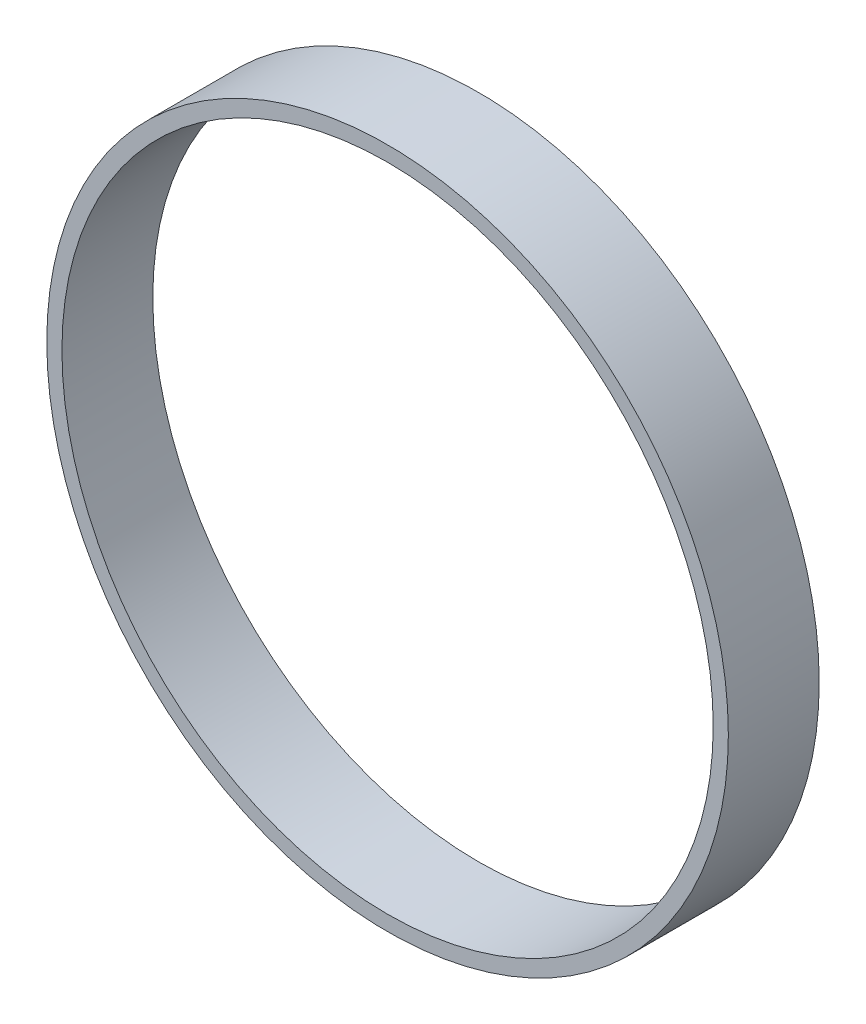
ISO-10303-21;
HEADER;
FILE_DESCRIPTION(('STEP AP214'),'2;1');
FILE_NAME('part.step','',(''),(''),'','','');
FILE_SCHEMA(('AUTOMOTIVE_DESIGN { 1 0 10303 214 1 1 1 1 }'));
ENDSEC;
DATA;
#1=APPLICATION_CONTEXT('core data for automotive mechanical design processes');
#2=APPLICATION_PROTOCOL_DEFINITION('international standard','automotive_design',2000,#1);
#3=PRODUCT_CONTEXT('',#1,'mechanical');
#4=PRODUCT('Part','Part','',(#3));
#5=PRODUCT_RELATED_PRODUCT_CATEGORY('part','',(#4));
#6=PRODUCT_DEFINITION_FORMATION('','',#4);
#7=PRODUCT_DEFINITION_CONTEXT('part definition',#1,'design');
#8=PRODUCT_DEFINITION('design','',#6,#7);
#9=PRODUCT_DEFINITION_SHAPE('','',#8);
#10=(LENGTH_UNIT() NAMED_UNIT(*) SI_UNIT(.MILLI.,.METRE.));
#11=(NAMED_UNIT(*) PLANE_ANGLE_UNIT() SI_UNIT($,.RADIAN.));
#12=(NAMED_UNIT(*) SI_UNIT($,.STERADIAN.) SOLID_ANGLE_UNIT());
#13=UNCERTAINTY_MEASURE_WITH_UNIT(LENGTH_MEASURE(1.E-05),#10,'distance_accuracy_value','');
#14=(GEOMETRIC_REPRESENTATION_CONTEXT(3) GLOBAL_UNCERTAINTY_ASSIGNED_CONTEXT((#13)) GLOBAL_UNIT_ASSIGNED_CONTEXT((#10,
#11,#12)) REPRESENTATION_CONTEXT('',''));
#15=CARTESIAN_POINT('',(0.,0.,0.));
#16=DIRECTION('',(0.,0.,1.));
#17=DIRECTION('',(1.,0.,0.));
#18=AXIS2_PLACEMENT_3D('',#15,#16,#17);
#19=CARTESIAN_POINT('',(-111.024419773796,0.,-17.221329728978));
#20=DIRECTION('',(0.,0.,-1.));
#21=DIRECTION('',(-1.,0.,0.));
#22=AXIS2_PLACEMENT_3D('',#19,#20,#21);
#23=PLANE('',#22);
#24=CARTESIAN_POINT('',(-111.024419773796,0.,-17.221329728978));
#25=DIRECTION('',(0.,0.,-1.));
#26=DIRECTION('',(-1.,0.,0.));
#27=AXIS2_PLACEMENT_3D('',#24,#25,#26);
#28=CIRCLE('',#27,45.0000000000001);
#29=CARTESIAN_POINT('',(-156.024419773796,0.,-17.221329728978));
#30=VERTEX_POINT('',#29);
#31=EDGE_CURVE('E11',#30,#30,#28,.T.);
#32=ORIENTED_EDGE('',*,*,#31,.T.);
#33=EDGE_LOOP('',(#32));
#34=FACE_BOUND('',#33,.T.);
#35=CARTESIAN_POINT('',(-111.024419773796,0.,-17.221329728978));
#36=DIRECTION('',(0.,0.,-1.));
#37=DIRECTION('',(-1.,0.,0.));
#38=AXIS2_PLACEMENT_3D('',#35,#36,#37);
#39=CIRCLE('',#38,43.);
#40=CARTESIAN_POINT('',(-154.024419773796,0.,-17.221329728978));
#41=VERTEX_POINT('',#40);
#42=EDGE_CURVE('E46',#41,#41,#39,.T.);
#43=ORIENTED_EDGE('',*,*,#42,.F.);
#44=EDGE_LOOP('',(#43));
#45=FACE_BOUND('',#44,.T.);
#46=ADVANCED_FACE('F35',(#34,#45),#23,.T.);
#47=CARTESIAN_POINT('',(-111.024419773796,0.,-5.221329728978));
#48=DIRECTION('',(0.,0.,-1.));
#49=DIRECTION('',(-1.,0.,0.));
#50=AXIS2_PLACEMENT_3D('',#47,#48,#49);
#51=PLANE('',#50);
#52=CARTESIAN_POINT('',(-111.024419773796,0.,-5.221329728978));
#53=DIRECTION('',(0.,0.,-1.));
#54=DIRECTION('',(-1.,0.,0.));
#55=AXIS2_PLACEMENT_3D('',#52,#53,#54);
#56=CIRCLE('',#55,45.0000000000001);
#57=CARTESIAN_POINT('',(-156.024419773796,0.,-5.221329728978));
#58=VERTEX_POINT('',#57);
#59=EDGE_CURVE('E39',#58,#58,#56,.T.);
#60=ORIENTED_EDGE('',*,*,#59,.F.);
#61=EDGE_LOOP('',(#60));
#62=FACE_BOUND('',#61,.T.);
#63=CARTESIAN_POINT('',(-111.024419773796,0.,-5.221329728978));
#64=DIRECTION('',(0.,0.,-1.));
#65=DIRECTION('',(-1.,0.,0.));
#66=AXIS2_PLACEMENT_3D('',#63,#64,#65);
#67=CIRCLE('',#66,43.);
#68=CARTESIAN_POINT('',(-154.024419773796,0.,-5.221329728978));
#69=VERTEX_POINT('',#68);
#70=EDGE_CURVE('E48',#69,#69,#67,.T.);
#71=ORIENTED_EDGE('',*,*,#70,.T.);
#72=EDGE_LOOP('',(#71));
#73=FACE_BOUND('',#72,.T.);
#74=ADVANCED_FACE('F58',(#62,#73),#51,.F.);
#75=CARTESIAN_POINT('',(-111.024419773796,0.,-17.221329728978));
#76=DIRECTION('',(0.,0.,1.));
#77=DIRECTION('',(1.,0.,0.));
#78=AXIS2_PLACEMENT_3D('',#75,#76,#77);
#79=CYLINDRICAL_SURFACE('',#78,45.0000000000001);
#80=ORIENTED_EDGE('',*,*,#31,.F.);
#81=EDGE_LOOP('',(#80));
#82=FACE_BOUND('',#81,.T.);
#83=ORIENTED_EDGE('',*,*,#59,.T.);
#84=EDGE_LOOP('',(#83));
#85=FACE_BOUND('',#84,.T.);
#86=ADVANCED_FACE('F37',(#82,#85),#79,.T.);
#87=CARTESIAN_POINT('',(-111.024419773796,0.,-17.221329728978));
#88=DIRECTION('',(0.,0.,1.));
#89=DIRECTION('',(1.,0.,0.));
#90=AXIS2_PLACEMENT_3D('',#87,#88,#89);
#91=CYLINDRICAL_SURFACE('',#90,43.);
#92=ORIENTED_EDGE('',*,*,#42,.T.);
#93=EDGE_LOOP('',(#92));
#94=FACE_BOUND('',#93,.T.);
#95=ORIENTED_EDGE('',*,*,#70,.F.);
#96=EDGE_LOOP('',(#95));
#97=FACE_BOUND('',#96,.T.);
#98=ADVANCED_FACE('F54',(#94,#97),#91,.F.);
#99=CLOSED_SHELL('',(#46,#74,#86,#98));
#100=MANIFOLD_SOLID_BREP('B2',#99);
#101=ADVANCED_BREP_SHAPE_REPRESENTATION('',(#18,#100),#14);
#102=SHAPE_DEFINITION_REPRESENTATION(#9,#101);
ENDSEC;
END-ISO-10303-21;
